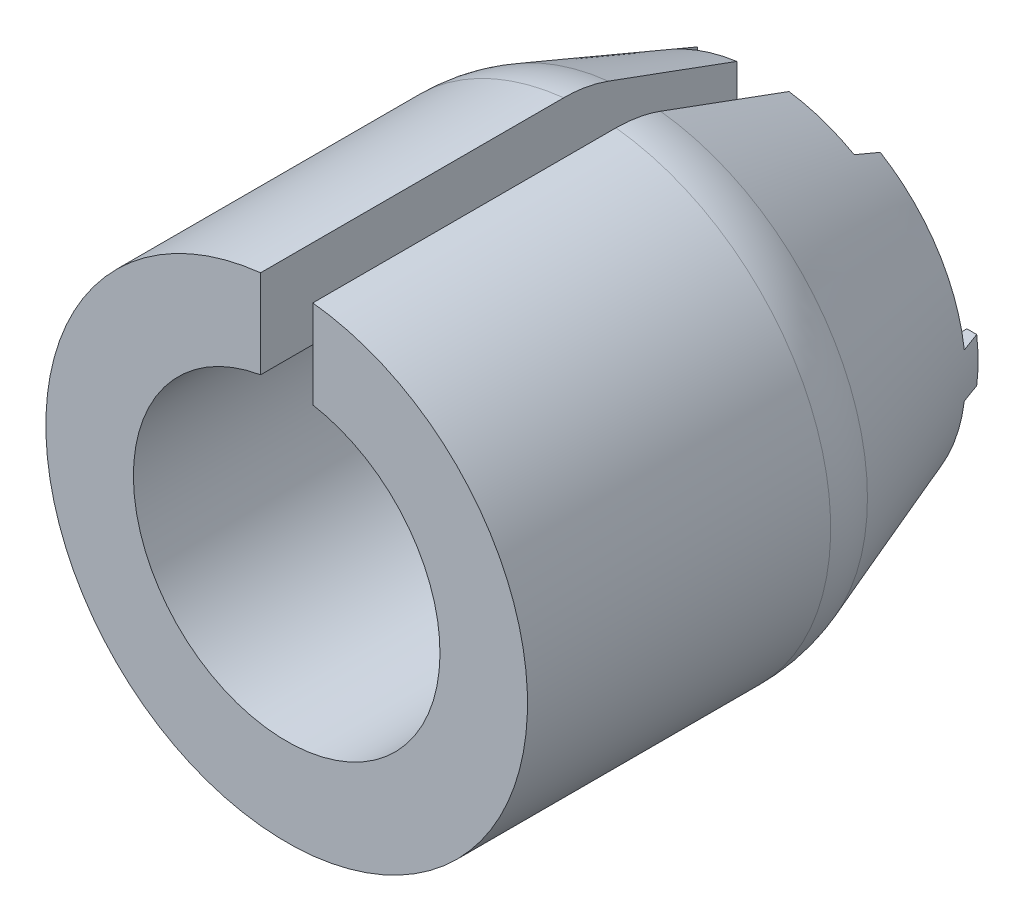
ISO-10303-21;
HEADER;
FILE_DESCRIPTION(('STEP AP214'),'2;1');
FILE_NAME('part.step','',(''),(''),'','','');
FILE_SCHEMA(('AUTOMOTIVE_DESIGN { 1 0 10303 214 1 1 1 1 }'));
ENDSEC;
DATA;
#1=APPLICATION_CONTEXT('core data for automotive mechanical design processes');
#2=APPLICATION_PROTOCOL_DEFINITION('international standard','automotive_design',2000,#1);
#3=PRODUCT_CONTEXT('',#1,'mechanical');
#4=PRODUCT('Part','Part','',(#3));
#5=PRODUCT_RELATED_PRODUCT_CATEGORY('part','',(#4));
#6=PRODUCT_DEFINITION_FORMATION('','',#4);
#7=PRODUCT_DEFINITION_CONTEXT('part definition',#1,'design');
#8=PRODUCT_DEFINITION('design','',#6,#7);
#9=PRODUCT_DEFINITION_SHAPE('','',#8);
#10=(LENGTH_UNIT() NAMED_UNIT(*) SI_UNIT(.MILLI.,.METRE.));
#11=(NAMED_UNIT(*) PLANE_ANGLE_UNIT() SI_UNIT($,.RADIAN.));
#12=(NAMED_UNIT(*) SI_UNIT($,.STERADIAN.) SOLID_ANGLE_UNIT());
#13=UNCERTAINTY_MEASURE_WITH_UNIT(LENGTH_MEASURE(1.E-05),#10,'distance_accuracy_value','');
#14=(GEOMETRIC_REPRESENTATION_CONTEXT(3) GLOBAL_UNCERTAINTY_ASSIGNED_CONTEXT((#13)) GLOBAL_UNIT_ASSIGNED_CONTEXT((#10,
#11,#12)) REPRESENTATION_CONTEXT('',''));
#15=CARTESIAN_POINT('',(0.,0.,0.));
#16=DIRECTION('',(0.,0.,1.));
#17=DIRECTION('',(1.,0.,0.));
#18=AXIS2_PLACEMENT_3D('',#15,#16,#17);
#19=CARTESIAN_POINT('',(2.,25.,15.));
#20=DIRECTION('',(1.,0.,0.));
#21=DIRECTION('',(0.,1.,0.));
#22=AXIS2_PLACEMENT_3D('',#19,#20,#21);
#23=PLANE('',#22);
#24=DIRECTION('',(0.,0.,-1.));
#25=VECTOR('',#24,1.);
#26=CARTESIAN_POINT('',(2.,18.3508886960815,40.));
#27=LINE('',#26,#25);
#28=CARTESIAN_POINT('',(2.,18.3508886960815,40.));
#29=VERTEX_POINT('',#28);
#30=CARTESIAN_POINT('',(2.,18.3508886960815,16.7632698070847));
#31=VERTEX_POINT('',#30);
#32=EDGE_CURVE('E210',#29,#31,#27,.T.);
#33=ORIENTED_EDGE('',*,*,#32,.T.);
#34=CARTESIAN_POINT('',(2.,18.3508886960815,16.7632698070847));
#35=CARTESIAN_POINT('',(2.,18.3509221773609,16.4711897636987));
#36=CARTESIAN_POINT('',(2.,18.3380164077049,16.1791158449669));
#37=CARTESIAN_POINT('',(2.,18.2867759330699,15.5994570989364));
#38=CARTESIAN_POINT('',(2.,18.2486362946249,15.3118550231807));
#39=CARTESIAN_POINT('',(2.,18.1473690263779,14.7410849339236));
#40=CARTESIAN_POINT('',(2.,18.084241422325,14.4579169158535));
#41=CARTESIAN_POINT('',(2.,17.9329556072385,13.8960077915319));
#42=CARTESIAN_POINT('',(2.,17.844608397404,13.6173175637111));
#43=CARTESIAN_POINT('',(2.,17.7441220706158,13.343068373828));
#44=B_SPLINE_CURVE_WITH_KNOTS('',3,(#34,#35,#36,#37,#38,#39,#40,#41,#42,#43),.UNSPECIFIED.,.F.,
.F.,(4,2,2,2,4),(0.,0.875945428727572,1.74519739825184,2.61444847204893,3.49039299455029),.UNSPECIFIED.);
#45=CARTESIAN_POINT('',(2.,17.7441220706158,13.343068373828));
#46=VERTEX_POINT('',#45);
#47=EDGE_CURVE('E54',#31,#46,#44,.T.);
#48=ORIENTED_EDGE('',*,*,#47,.T.);
#49=CARTESIAN_POINT('',(2.,6.41526344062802,-17.2547295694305));
#50=CARTESIAN_POINT('',(2.,6.56390800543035,-16.8648244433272));
#51=CARTESIAN_POINT('',(2.,6.7121636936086,-16.4747713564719));
#52=CARTESIAN_POINT('',(2.,7.0080167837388,-15.6944159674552));
#53=CARTESIAN_POINT('',(2.,7.15561418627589,-15.3041136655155));
#54=CARTESIAN_POINT('',(2.,7.59759766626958,-14.1329043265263));
#55=CARTESIAN_POINT('',(2.,7.89117591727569,-13.3516924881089));
#56=CARTESIAN_POINT('',(2.,8.476797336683,-11.7887002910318));
#57=CARTESIAN_POINT('',(2.,8.76884051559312,-11.006919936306));
#58=CARTESIAN_POINT('',(2.,9.35178663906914,-9.44293356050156));
#59=CARTESIAN_POINT('',(2.,9.64268958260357,-8.6607275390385));
#60=CARTESIAN_POINT('',(2.,10.533850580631,-6.26048030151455));
#61=CARTESIAN_POINT('',(2.,11.1327080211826,-4.64191919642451));
#62=CARTESIAN_POINT('',(2.,12.3282153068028,-1.40397856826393));
#63=CARTESIAN_POINT('',(2.,12.9248651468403,0.215400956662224));
#64=CARTESIAN_POINT('',(2.,14.10690648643,3.42807582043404));
#65=CARTESIAN_POINT('',(2.,14.6923218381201,5.02136238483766));
#66=CARTESIAN_POINT('',(2.,15.8621656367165,8.20829774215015));
#67=CARTESIAN_POINT('',(2.,16.4465940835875,9.801946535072));
#68=CARTESIAN_POINT('',(2.,18.1988245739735,14.5832760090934));
#69=CARTESIAN_POINT('',(2.,19.3655728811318,17.7713428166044));
#70=CARTESIAN_POINT('',(2.,21.593649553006,23.8641314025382));
#71=CARTESIAN_POINT('',(2.,22.6551132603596,26.7688037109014));
#72=CARTESIAN_POINT('',(2.,24.7771645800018,32.5784684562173));
#73=CARTESIAN_POINT('',(2.,25.8377521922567,35.4834608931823));
#74=CARTESIAN_POINT('',(2.,27.9583314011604,41.2936645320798));
#75=CARTESIAN_POINT('',(2.,29.0183229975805,44.1988757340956));
#76=CARTESIAN_POINT('',(2.,31.1378659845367,50.0094584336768));
#77=CARTESIAN_POINT('',(2.,32.1974173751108,52.9148299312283));
#78=CARTESIAN_POINT('',(2.,33.2568268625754,55.8202531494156));
#79=B_SPLINE_CURVE_WITH_KNOTS('',3,(#49,#50,#51,#52,#53,#54,#55,#56,#57,#58,#59,#60,#61,#62,#63,
#64,#65,#66,#67,#68,#69,#70,#71,#72,#73,#74,#75,#76,#77,#78),.UNSPECIFIED.,.F.,.F.,(4,2,2,2,2,2,
2,2,2,2,2,2,2,2,4),(0.,1.25183440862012,2.50366770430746,5.00732669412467,7.51096852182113,
10.0146126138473,15.1919960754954,20.3693913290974,25.4616848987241,30.5539786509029,
40.7385564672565,50.0161873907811,59.2938186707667,68.5714535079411,77.8490875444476),.UNSPECIFIED.);
#80=CARTESIAN_POINT('',(2.,14.1330853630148,3.5));
#81=VERTEX_POINT('',#80);
#82=EDGE_CURVE('E340',#81,#46,#79,.T.);
#83=ORIENTED_EDGE('',*,*,#82,.F.);
#84=DIRECTION('',(0.,-1.,0.));
#85=VECTOR('',#84,1.);
#86=CARTESIAN_POINT('',(2.,0.,3.5));
#87=LINE('',#86,#85);
#88=CARTESIAN_POINT('',(2.,11.5785361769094,3.5));
#89=VERTEX_POINT('',#88);
#90=EDGE_CURVE('E191',#81,#89,#87,.T.);
#91=ORIENTED_EDGE('',*,*,#90,.T.);
#92=DIRECTION('',(0.,0.,-1.));
#93=VECTOR('',#92,1.);
#94=CARTESIAN_POINT('',(2.,11.5785361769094,15.));
#95=LINE('',#94,#93);
#96=CARTESIAN_POINT('',(2.00000000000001,11.5785361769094,40.));
#97=VERTEX_POINT('',#96);
#98=EDGE_CURVE('E341',#89,#97,#95,.F.);
#99=ORIENTED_EDGE('',*,*,#98,.T.);
#100=DIRECTION('',(0.,-1.,0.));
#101=VECTOR('',#100,1.);
#102=CARTESIAN_POINT('',(2.,18.3508886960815,40.));
#103=LINE('',#102,#101);
#104=EDGE_CURVE('E205',#29,#97,#103,.T.);
#105=ORIENTED_EDGE('',*,*,#104,.F.);
#106=EDGE_LOOP('',(#33,#48,#83,#91,#99,#105));
#107=FACE_BOUND('',#106,.T.);
#108=ADVANCED_FACE('F26',(#107),#23,.F.);
#109=CARTESIAN_POINT('',(-2.,25.,15.));
#110=DIRECTION('',(-1.,0.,0.));
#111=DIRECTION('',(0.,-1.,0.));
#112=AXIS2_PLACEMENT_3D('',#109,#110,#111);
#113=PLANE('',#112);
#114=CARTESIAN_POINT('',(-2.,6.41526344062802,-17.2547295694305));
#115=CARTESIAN_POINT('',(-2.,6.56390800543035,-16.8648244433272));
#116=CARTESIAN_POINT('',(-2.,6.7121636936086,-16.4747713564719));
#117=CARTESIAN_POINT('',(-2.,7.0080167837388,-15.6944159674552));
#118=CARTESIAN_POINT('',(-2.,7.15561418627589,-15.3041136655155));
#119=CARTESIAN_POINT('',(-2.,7.59759766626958,-14.1329043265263));
#120=CARTESIAN_POINT('',(-2.,7.89117591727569,-13.3516924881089));
#121=CARTESIAN_POINT('',(-2.,8.476797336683,-11.7887002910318));
#122=CARTESIAN_POINT('',(-2.,8.76884051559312,-11.006919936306));
#123=CARTESIAN_POINT('',(-2.,9.35178663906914,-9.44293356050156));
#124=CARTESIAN_POINT('',(-2.,9.64268958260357,-8.6607275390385));
#125=CARTESIAN_POINT('',(-2.,10.533850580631,-6.26048030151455));
#126=CARTESIAN_POINT('',(-2.,11.1327080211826,-4.64191919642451));
#127=CARTESIAN_POINT('',(-2.,12.3282153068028,-1.40397856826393));
#128=CARTESIAN_POINT('',(-2.,12.9248651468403,0.215400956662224));
#129=CARTESIAN_POINT('',(-2.,14.10690648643,3.42807582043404));
#130=CARTESIAN_POINT('',(-2.,14.6923218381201,5.02136238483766));
#131=CARTESIAN_POINT('',(-2.,15.8621656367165,8.20829774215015));
#132=CARTESIAN_POINT('',(-2.,16.4465940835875,9.801946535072));
#133=CARTESIAN_POINT('',(-2.,18.1988245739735,14.5832760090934));
#134=CARTESIAN_POINT('',(-2.,19.3655728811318,17.7713428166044));
#135=CARTESIAN_POINT('',(-2.,21.593649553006,23.8641314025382));
#136=CARTESIAN_POINT('',(-2.,22.6551132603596,26.7688037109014));
#137=CARTESIAN_POINT('',(-2.,24.7771645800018,32.5784684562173));
#138=CARTESIAN_POINT('',(-2.,25.8377521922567,35.4834608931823));
#139=CARTESIAN_POINT('',(-2.,27.9583314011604,41.2936645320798));
#140=CARTESIAN_POINT('',(-2.,29.0183229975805,44.1988757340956));
#141=CARTESIAN_POINT('',(-2.,31.1378659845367,50.0094584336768));
#142=CARTESIAN_POINT('',(-2.,32.1974173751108,52.9148299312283));
#143=CARTESIAN_POINT('',(-2.,33.2568268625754,55.8202531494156));
#144=B_SPLINE_CURVE_WITH_KNOTS('',3,(#114,#115,#116,#117,#118,#119,#120,#121,#122,#123,#124,
#125,#126,#127,#128,#129,#130,#131,#132,#133,#134,#135,#136,#137,#138,#139,#140,#141,#142,#143),
.UNSPECIFIED.,.F.,.F.,(4,2,2,2,2,2,2,2,2,2,2,2,2,2,4),(0.,1.25183440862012,2.50366770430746,
5.00732669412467,7.51096852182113,10.0146126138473,15.1919960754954,20.3693913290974,
25.4616848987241,30.5539786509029,40.7385564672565,50.0161873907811,59.2938186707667,
68.5714535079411,77.8490875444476),.UNSPECIFIED.);
#145=CARTESIAN_POINT('',(-2.,17.7441220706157,13.3430683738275));
#146=VERTEX_POINT('',#145);
#147=CARTESIAN_POINT('',(-2.,14.1330853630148,3.5));
#148=VERTEX_POINT('',#147);
#149=EDGE_CURVE('E334',#146,#148,#144,.F.);
#150=ORIENTED_EDGE('',*,*,#149,.F.);
#151=CARTESIAN_POINT('',(-1.99999999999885,17.744122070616,13.343068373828));
#152=CARTESIAN_POINT('',(-1.99999999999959,17.8446083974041,13.6173175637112));
#153=CARTESIAN_POINT('',(-1.99999999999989,17.9329556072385,13.8960077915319));
#154=CARTESIAN_POINT('',(-2.00000000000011,18.084241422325,14.4579169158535));
#155=CARTESIAN_POINT('',(-2.00000000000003,18.1473690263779,14.7410849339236));
#156=CARTESIAN_POINT('',(-1.99999999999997,18.2486362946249,15.3118550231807));
#157=CARTESIAN_POINT('',(-1.99999999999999,18.2867759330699,15.5994570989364));
#158=CARTESIAN_POINT('',(-2.00000000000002,18.3380164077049,16.1791158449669));
#159=CARTESIAN_POINT('',(-2.00000000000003,18.3509221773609,16.4711897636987));
#160=CARTESIAN_POINT('',(-2.,18.3508886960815,16.7632698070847));
#161=B_SPLINE_CURVE_WITH_KNOTS('',3,(#151,#152,#153,#154,#155,#156,#157,#158,#159,#160),
.UNSPECIFIED.,.F.,.F.,(4,2,2,2,4),(0.,0.875944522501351,1.74519559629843,2.61444756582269,
3.49039299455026),.UNSPECIFIED.);
#162=CARTESIAN_POINT('',(-2.,18.3508886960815,16.7632698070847));
#163=VERTEX_POINT('',#162);
#164=EDGE_CURVE('E11',#146,#163,#161,.T.);
#165=ORIENTED_EDGE('',*,*,#164,.T.);
#166=DIRECTION('',(0.,0.,-1.));
#167=VECTOR('',#166,1.);
#168=CARTESIAN_POINT('',(-2.,18.3508886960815,40.));
#169=LINE('',#168,#167);
#170=CARTESIAN_POINT('',(-2.,18.3508886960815,40.));
#171=VERTEX_POINT('',#170);
#172=EDGE_CURVE('E197',#171,#163,#169,.T.);
#173=ORIENTED_EDGE('',*,*,#172,.F.);
#174=DIRECTION('',(0.,1.,0.));
#175=VECTOR('',#174,1.);
#176=CARTESIAN_POINT('',(-2.,11.5785361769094,40.));
#177=LINE('',#176,#175);
#178=CARTESIAN_POINT('',(-2.,11.5785361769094,40.));
#179=VERTEX_POINT('',#178);
#180=EDGE_CURVE('E194',#179,#171,#177,.T.);
#181=ORIENTED_EDGE('',*,*,#180,.F.);
#182=DIRECTION('',(0.,0.,-1.));
#183=VECTOR('',#182,1.);
#184=CARTESIAN_POINT('',(-2.,11.5785361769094,15.));
#185=LINE('',#184,#183);
#186=CARTESIAN_POINT('',(-2.,11.5785361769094,3.5));
#187=VERTEX_POINT('',#186);
#188=EDGE_CURVE('E180',#179,#187,#185,.T.);
#189=ORIENTED_EDGE('',*,*,#188,.T.);
#190=DIRECTION('',(0.,1.,0.));
#191=VECTOR('',#190,1.);
#192=CARTESIAN_POINT('',(-2.,0.,3.5));
#193=LINE('',#192,#191);
#194=EDGE_CURVE('E355',#187,#148,#193,.T.);
#195=ORIENTED_EDGE('',*,*,#194,.T.);
#196=EDGE_LOOP('',(#150,#165,#173,#181,#189,#195));
#197=FACE_BOUND('',#196,.T.);
#198=ADVANCED_FACE('F195',(#197),#113,.F.);
#199=CARTESIAN_POINT('',(0.,0.,3.5));
#200=DIRECTION('',(0.,0.,-1.));
#201=DIRECTION('',(-1.,0.,0.));
#202=AXIS2_PLACEMENT_3D('',#199,#200,#201);
#203=CYLINDRICAL_SURFACE('',#202,12.25);
#204=CARTESIAN_POINT('',(0.,0.,1.5));
#205=DIRECTION('',(0.,0.,1.));
#206=DIRECTION('',(-1.,0.,0.));
#207=AXIS2_PLACEMENT_3D('',#204,#205,#206);
#208=CIRCLE('',#207,12.25);
#209=CARTESIAN_POINT('',(7.,-10.0529846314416,1.5));
#210=VERTEX_POINT('',#209);
#211=CARTESIAN_POINT('',(12.1314673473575,-1.7,1.5));
#212=VERTEX_POINT('',#211);
#213=EDGE_CURVE('E283',#210,#212,#208,.T.);
#214=ORIENTED_EDGE('',*,*,#213,.F.);
#215=DIRECTION('',(0.,0.,-1.));
#216=VECTOR('',#215,1.);
#217=CARTESIAN_POINT('',(7.,-10.0529846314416,3.5));
#218=LINE('',#217,#216);
#219=CARTESIAN_POINT('',(7.,-10.0529846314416,3.5));
#220=VERTEX_POINT('',#219);
#221=EDGE_CURVE('E228',#210,#220,#218,.F.);
#222=ORIENTED_EDGE('',*,*,#221,.T.);
#223=CARTESIAN_POINT('',(0.,0.,3.5));
#224=DIRECTION('',(0.,0.,-1.));
#225=DIRECTION('',(-1.,0.,0.));
#226=AXIS2_PLACEMENT_3D('',#223,#224,#225);
#227=CIRCLE('',#226,12.25);
#228=CARTESIAN_POINT('',(7.,10.0529846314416,3.5));
#229=VERTEX_POINT('',#228);
#230=EDGE_CURVE('E352',#229,#220,#227,.T.);
#231=ORIENTED_EDGE('',*,*,#230,.F.);
#232=DIRECTION('',(0.,0.,-1.));
#233=VECTOR('',#232,1.);
#234=CARTESIAN_POINT('',(7.,10.0529846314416,3.5));
#235=LINE('',#234,#233);
#236=CARTESIAN_POINT('',(7.,10.0529846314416,1.5));
#237=VERTEX_POINT('',#236);
#238=EDGE_CURVE('E225',#229,#237,#235,.T.);
#239=ORIENTED_EDGE('',*,*,#238,.T.);
#240=CARTESIAN_POINT('',(0.,0.,1.5));
#241=DIRECTION('',(0.,0.,1.));
#242=DIRECTION('',(-1.,0.,0.));
#243=AXIS2_PLACEMENT_3D('',#240,#241,#242);
#244=CIRCLE('',#243,12.25);
#245=CARTESIAN_POINT('',(12.1314673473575,1.7,1.5));
#246=VERTEX_POINT('',#245);
#247=EDGE_CURVE('E412',#246,#237,#244,.T.);
#248=ORIENTED_EDGE('',*,*,#247,.F.);
#249=DIRECTION('',(0.,0.,-1.));
#250=VECTOR('',#249,1.);
#251=CARTESIAN_POINT('',(12.1314673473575,1.7,1.5));
#252=LINE('',#251,#250);
#253=CARTESIAN_POINT('',(12.1314673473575,1.7,0.));
#254=VERTEX_POINT('',#253);
#255=EDGE_CURVE('E421',#246,#254,#252,.T.);
#256=ORIENTED_EDGE('',*,*,#255,.T.);
#257=CARTESIAN_POINT('',(0.,0.,0.));
#258=DIRECTION('',(0.,0.,-1.));
#259=DIRECTION('',(-1.,0.,0.));
#260=AXIS2_PLACEMENT_3D('',#257,#258,#259);
#261=CIRCLE('',#260,12.25);
#262=CARTESIAN_POINT('',(12.1314673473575,-1.7,0.));
#263=VERTEX_POINT('',#262);
#264=EDGE_CURVE('E347',#254,#263,#261,.T.);
#265=ORIENTED_EDGE('',*,*,#264,.T.);
#266=DIRECTION('',(0.,0.,-1.));
#267=VECTOR('',#266,1.);
#268=CARTESIAN_POINT('',(12.1314673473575,-1.7,1.5));
#269=LINE('',#268,#267);
#270=EDGE_CURVE('E293',#212,#263,#269,.T.);
#271=ORIENTED_EDGE('',*,*,#270,.F.);
#272=EDGE_LOOP('',(#214,#222,#231,#239,#248,#256,#265,#271));
#273=FACE_BOUND('',#272,.T.);
#274=ADVANCED_FACE('F329',(#273),#203,.F.);
#275=CARTESIAN_POINT('',(0.,0.,1.5));
#276=DIRECTION('',(0.,0.,-1.));
#277=DIRECTION('',(-1.,0.,0.));
#278=AXIS2_PLACEMENT_3D('',#275,#276,#277);
#279=PLANE('',#278);
#280=DIRECTION('',(0.,-1.,0.));
#281=VECTOR('',#280,1.);
#282=CARTESIAN_POINT('',(7.,15.,1.5));
#283=LINE('',#282,#281);
#284=CARTESIAN_POINT('',(7.,-11.5971076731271,1.5));
#285=VERTEX_POINT('',#284);
#286=EDGE_CURVE('E213',#210,#285,#283,.T.);
#287=ORIENTED_EDGE('',*,*,#286,.F.);
#288=ORIENTED_EDGE('',*,*,#213,.T.);
#289=DIRECTION('',(1.,0.,0.));
#290=VECTOR('',#289,1.);
#291=CARTESIAN_POINT('',(12.1314673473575,-1.7,1.5));
#292=LINE('',#291,#290);
#293=CARTESIAN_POINT('',(13.4388580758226,-1.7,1.5));
#294=VERTEX_POINT('',#293);
#295=EDGE_CURVE('E287',#212,#294,#292,.T.);
#296=ORIENTED_EDGE('',*,*,#295,.T.);
#297=CARTESIAN_POINT('',(0.,0.,1.5));
#298=DIRECTION('',(0.,0.,-1.));
#299=DIRECTION('',(-1.,0.,0.));
#300=AXIS2_PLACEMENT_3D('',#297,#298,#299);
#301=CIRCLE('',#300,13.5459553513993);
#302=EDGE_CURVE('E300',#294,#285,#301,.T.);
#303=ORIENTED_EDGE('',*,*,#302,.T.);
#304=EDGE_LOOP('',(#287,#288,#296,#303));
#305=FACE_BOUND('',#304,.T.);
#306=ADVANCED_FACE('F473',(#305),#279,.T.);
#307=CARTESIAN_POINT('',(0.,0.,0.));
#308=DIRECTION('',(0.,0.,1.));
#309=DIRECTION('',(1.,0.,0.));
#310=AXIS2_PLACEMENT_3D('',#307,#308,#309);
#311=PLANE('',#310);
#312=CARTESIAN_POINT('',(0.,0.,0.));
#313=DIRECTION('',(0.,0.,1.));
#314=DIRECTION('',(1.,0.,0.));
#315=AXIS2_PLACEMENT_3D('',#312,#313,#314);
#316=CIRCLE('',#315,13.);
#317=CARTESIAN_POINT('',(-12.8883668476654,1.7,0.));
#318=VERTEX_POINT('',#317);
#319=CARTESIAN_POINT('',(-12.8883668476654,-1.7,0.));
#320=VERTEX_POINT('',#319);
#321=EDGE_CURVE('E353',#318,#320,#316,.T.);
#322=ORIENTED_EDGE('',*,*,#321,.F.);
#323=DIRECTION('',(-1.,0.,0.));
#324=VECTOR('',#323,1.);
#325=CARTESIAN_POINT('',(-12.1314673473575,1.7,0.));
#326=LINE('',#325,#324);
#327=CARTESIAN_POINT('',(-12.1314673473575,1.7,0.));
#328=VERTEX_POINT('',#327);
#329=EDGE_CURVE('E401',#328,#318,#326,.T.);
#330=ORIENTED_EDGE('',*,*,#329,.F.);
#331=CARTESIAN_POINT('',(-12.1314673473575,-1.7,0.));
#332=VERTEX_POINT('',#331);
#333=EDGE_CURVE('E346',#332,#328,#261,.T.);
#334=ORIENTED_EDGE('',*,*,#333,.F.);
#335=DIRECTION('',(1.,0.,0.));
#336=VECTOR('',#335,1.);
#337=CARTESIAN_POINT('',(-12.1314673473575,-1.7,0.));
#338=LINE('',#337,#336);
#339=EDGE_CURVE('E281',#320,#332,#338,.T.);
#340=ORIENTED_EDGE('',*,*,#339,.F.);
#341=EDGE_LOOP('',(#322,#330,#334,#340));
#342=FACE_BOUND('',#341,.T.);
#343=ADVANCED_FACE('F437',(#342),#311,.F.);
#344=CARTESIAN_POINT('',(0.,0.,0.));
#345=DIRECTION('',(0.,0.,1.));
#346=DIRECTION('',(1.,0.,0.));
#347=AXIS2_PLACEMENT_3D('',#344,#345,#346);
#348=CONICAL_SURFACE('',#347,13.,0.349065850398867);
#349=ORIENTED_EDGE('',*,*,#82,.T.);
#350=CARTESIAN_POINT('',(0.,0.,13.343068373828));
#351=DIRECTION('',(0.,0.,-1.));
#352=DIRECTION('',(-1.,0.,0.));
#353=AXIS2_PLACEMENT_3D('',#350,#351,#352);
#354=CIRCLE('',#353,17.8564797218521);
#355=EDGE_CURVE('E40',#46,#146,#354,.T.);
#356=ORIENTED_EDGE('',*,*,#355,.T.);
#357=ORIENTED_EDGE('',*,*,#149,.T.);
#358=CARTESIAN_POINT('',(0.,0.,3.5));
#359=DIRECTION('',(0.,0.,-1.));
#360=DIRECTION('',(-1.,0.,0.));
#361=AXIS2_PLACEMENT_3D('',#358,#359,#360);
#362=CIRCLE('',#361,14.2738958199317);
#363=CARTESIAN_POINT('',(-7.,12.4396182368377,3.5));
#364=VERTEX_POINT('',#363);
#365=EDGE_CURVE('E390',#364,#148,#362,.T.);
#366=ORIENTED_EDGE('',*,*,#365,.F.);
#367=CARTESIAN_POINT('',(-7.,19.6291767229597,21.5401556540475));
#368=CARTESIAN_POINT('',(-7.,19.3988615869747,20.9441395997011));
#369=CARTESIAN_POINT('',(-7.,19.1681520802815,20.3482759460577));
#370=CARTESIAN_POINT('',(-7.,18.7058473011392,19.1568917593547));
#371=CARTESIAN_POINT('',(-7.,18.4742520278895,18.5613712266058));
#372=CARTESIAN_POINT('',(-7.,17.7779749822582,16.7753380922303));
#373=CARTESIAN_POINT('',(-7.,17.3118194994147,15.5853993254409));
#374=CARTESIAN_POINT('',(-7.,16.3737448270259,13.205409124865));
#375=CARTESIAN_POINT('',(-7.,15.9018170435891,12.0153610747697));
#376=CARTESIAN_POINT('',(-7.,14.9515589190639,9.63785907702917));
#377=CARTESIAN_POINT('',(-7.,14.4732287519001,8.45040505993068));
#378=CARTESIAN_POINT('',(-7.,13.4964177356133,6.05024495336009));
#379=CARTESIAN_POINT('',(-7.,12.9977293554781,4.83762303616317));
#380=CARTESIAN_POINT('',(-7.,12.2404200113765,3.02249782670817));
#381=CARTESIAN_POINT('',(-7.,11.986426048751,2.41806417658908));
#382=CARTESIAN_POINT('',(-7.,11.4747223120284,1.21077230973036));
#383=CARTESIAN_POINT('',(-7.,11.2170125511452,0.607914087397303));
#384=CARTESIAN_POINT('',(-7.,10.6973239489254,-0.595332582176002));
#385=CARTESIAN_POINT('',(-7.,10.4353490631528,-1.19572273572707));
#386=CARTESIAN_POINT('',(-7.,9.90587230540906,-2.39405987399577));
#387=CARTESIAN_POINT('',(-7.,9.63837048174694,-2.99200688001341));
#388=CARTESIAN_POINT('',(-7.,9.09646374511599,-4.18467024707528));
#389=CARTESIAN_POINT('',(-7.,8.82205979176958,-4.77938704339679));
#390=CARTESIAN_POINT('',(-7.,8.26436456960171,-5.96463042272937));
#391=CARTESIAN_POINT('',(-7.,7.98107369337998,-6.55515718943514));
#392=CARTESIAN_POINT('',(-7.,7.55800689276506,-7.41479923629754));
#393=CARTESIAN_POINT('',(-7.,7.4228684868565,-7.68619807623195));
#394=CARTESIAN_POINT('',(-7.,7.14965449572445,-8.22752002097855));
#395=CARTESIAN_POINT('',(-7.,7.01157887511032,-8.49744310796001));
#396=CARTESIAN_POINT('',(-7.,6.73194430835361,-9.03566196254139));
#397=CARTESIAN_POINT('',(-7.,6.59038356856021,-9.30395679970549));
#398=CARTESIAN_POINT('',(-7.,6.30324991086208,-9.83838996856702));
#399=CARTESIAN_POINT('',(-7.,6.15767705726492,-10.1045283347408));
#400=CARTESIAN_POINT('',(-7.,5.86163018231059,-10.6343661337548));
#401=CARTESIAN_POINT('',(-7.,5.71115213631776,-10.8980633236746));
#402=CARTESIAN_POINT('',(-7.,5.40442805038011,-11.4220784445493));
#403=CARTESIAN_POINT('',(-7.,5.2481822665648,-11.6823965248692));
#404=CARTESIAN_POINT('',(-7.,4.92873183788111,-12.1984615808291));
#405=CARTESIAN_POINT('',(-7.,4.76553276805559,-12.4542119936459));
#406=CARTESIAN_POINT('',(-7.,4.43032534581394,-12.959846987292));
#407=CARTESIAN_POINT('',(-7.,4.25831878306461,-13.2097327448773));
#408=CARTESIAN_POINT('',(-7.,3.9374060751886,-13.653769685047));
#409=CARTESIAN_POINT('',(-7.,3.79047674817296,-13.8493431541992));
#410=CARTESIAN_POINT('',(-7.,3.48738085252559,-14.2334619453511));
#411=CARTESIAN_POINT('',(-7.,3.3312086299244,-14.4220028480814));
#412=CARTESIAN_POINT('',(-7.,3.0082569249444,-14.7879793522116));
#413=CARTESIAN_POINT('',(-7.,2.84154237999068,-14.9654716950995));
#414=CARTESIAN_POINT('',(-7.,2.49382772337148,-15.3056980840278));
#415=CARTESIAN_POINT('',(-7.,2.31284853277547,-15.4684530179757));
#416=CARTESIAN_POINT('',(-7.,1.97896799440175,-15.7346270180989));
#417=CARTESIAN_POINT('',(-7.,1.82994980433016,-15.8428477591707));
#418=CARTESIAN_POINT('',(-7.,1.5198624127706,-16.0411298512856));
#419=CARTESIAN_POINT('',(-7.,1.35878244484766,-16.1311747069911));
#420=CARTESIAN_POINT('',(-7.,1.02153987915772,-16.2865498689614));
#421=CARTESIAN_POINT('',(-7.,0.845185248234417,-16.3514837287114));
#422=CARTESIAN_POINT('',(-7.,0.573972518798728,-16.421911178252));
#423=CARTESIAN_POINT('',(-7.,0.482545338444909,-16.4408861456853));
#424=CARTESIAN_POINT('',(-7.,0.298178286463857,-16.4690797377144));
#425=CARTESIAN_POINT('',(-7.,0.205238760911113,-16.4783005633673));
#426=CARTESIAN_POINT('',(-7.,0.03050664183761,-16.4859885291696));
#427=CARTESIAN_POINT('',(-7.,-0.0512350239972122,-16.4856502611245));
#428=CARTESIAN_POINT('',(-7.,-0.21432306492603,-16.4771595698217));
#429=CARTESIAN_POINT('',(-7.,-0.29566930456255,-16.4690046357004));
#430=CARTESIAN_POINT('',(-7.,-0.538162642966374,-16.4331884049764));
#431=CARTESIAN_POINT('',(-7.,-0.697705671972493,-16.3941734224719));
#432=CARTESIAN_POINT('',(-7.,-1.04905238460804,-16.2774876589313));
#433=CARTESIAN_POINT('',(-7.,-1.23829984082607,-16.1923471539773));
#434=CARTESIAN_POINT('',(-7.,-1.51038253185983,-16.04378973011));
#435=CARTESIAN_POINT('',(-7.,-1.59922460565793,-15.9907098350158));
#436=CARTESIAN_POINT('',(-7.,-1.77320282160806,-15.8787626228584));
#437=CARTESIAN_POINT('',(-7.,-1.85833924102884,-15.8198957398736));
#438=CARTESIAN_POINT('',(-7.,-2.04365365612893,-15.6838082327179));
#439=CARTESIAN_POINT('',(-7.,-2.14296581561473,-15.6054174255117));
#440=CARTESIAN_POINT('',(-7.,-2.33690698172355,-15.4430156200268));
#441=CARTESIAN_POINT('',(-7.,-2.43153415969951,-15.3590024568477));
#442=CARTESIAN_POINT('',(-7.,-2.70942699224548,-15.1000541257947));
#443=CARTESIAN_POINT('',(-7.,-2.88643913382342,-14.9184131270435));
#444=CARTESIAN_POINT('',(-7.,-3.22853677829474,-14.5422296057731));
#445=CARTESIAN_POINT('',(-7.,-3.39353394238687,-14.3476084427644));
#446=CARTESIAN_POINT('',(-7.,-3.63316911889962,-14.0495729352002));
#447=CARTESIAN_POINT('',(-7.,-3.71170456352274,-13.9492559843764));
#448=CARTESIAN_POINT('',(-7.,-3.8664587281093,-13.7468559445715));
#449=CARTESIAN_POINT('',(-7.,-3.94267752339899,-13.6447729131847));
#450=CARTESIAN_POINT('',(-7.,-4.18073809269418,-13.3191871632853));
#451=CARTESIAN_POINT('',(-7.,-4.33878473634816,-13.0929065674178));
#452=CARTESIAN_POINT('',(-7.,-4.6472128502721,-12.6351609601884));
#453=CARTESIAN_POINT('',(-7.,-4.7975927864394,-12.4036949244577));
#454=CARTESIAN_POINT('',(-7.,-5.09219649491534,-11.936684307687));
#455=CARTESIAN_POINT('',(-7.,-5.23641629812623,-11.701137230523));
#456=CARTESIAN_POINT('',(-7.,-5.51969784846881,-11.2269534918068));
#457=CARTESIAN_POINT('',(-7.,-5.65875928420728,-10.9883166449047));
#458=CARTESIAN_POINT('',(-7.,-5.93290787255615,-10.5079639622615));
#459=CARTESIAN_POINT('',(-7.,-6.06798390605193,-10.2662417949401));
#460=CARTESIAN_POINT('',(-7.,-6.33444822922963,-9.78077048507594));
#461=CARTESIAN_POINT('',(-7.,-6.46583642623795,-9.53702129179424));
#462=CARTESIAN_POINT('',(-7.,-6.8551816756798,-8.80346796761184));
#463=CARTESIAN_POINT('',(-7.,-7.10842917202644,-8.31116349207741));
#464=CARTESIAN_POINT('',(-7.,-7.60602568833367,-7.32069234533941));
#465=CARTESIAN_POINT('',(-7.,-7.85035291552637,-6.82251480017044));
#466=CARTESIAN_POINT('',(-7.,-8.33161339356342,-5.82255566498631));
#467=CARTESIAN_POINT('',(-7.,-8.56854600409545,-5.32077376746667));
#468=CARTESIAN_POINT('',(-7.,-9.03613508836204,-4.31525572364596));
#469=CARTESIAN_POINT('',(-7.,-9.26680079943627,-3.81152386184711));
#470=CARTESIAN_POINT('',(-7.,-9.7233344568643,-2.80191117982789));
#471=CARTESIAN_POINT('',(-7.,-9.94920253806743,-2.29603042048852));
#472=CARTESIAN_POINT('',(-7.,-10.3869894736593,-1.30513617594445));
#473=CARTESIAN_POINT('',(-7.,-10.599081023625,-0.820198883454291));
#474=CARTESIAN_POINT('',(-7.,-11.0202107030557,0.151000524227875));
#475=CARTESIAN_POINT('',(-7.,-11.2292488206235,0.637262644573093));
#476=CARTESIAN_POINT('',(-7.,-11.8524869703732,2.09772692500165));
#477=CARTESIAN_POINT('',(-7.,-12.2628020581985,3.0735871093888));
#478=CARTESIAN_POINT('',(-7.,-13.0759911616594,5.02919079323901));
#479=CARTESIAN_POINT('',(-7.,-13.4788597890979,6.00893652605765));
#480=CARTESIAN_POINT('',(-7.,-14.2786278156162,7.97086375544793));
#481=CARTESIAN_POINT('',(-7.,-14.6755271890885,8.95304526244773));
#482=CARTESIAN_POINT('',(-7.,-15.4572005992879,10.9008135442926));
#483=CARTESIAN_POINT('',(-7.,-15.8420623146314,11.8663651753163));
#484=CARTESIAN_POINT('',(-7.,-16.6081245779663,13.7989233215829));
#485=CARTESIAN_POINT('',(-7.,-16.9893251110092,14.7659298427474));
#486=CARTESIAN_POINT('',(-7.,-17.7483908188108,16.7002577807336));
#487=CARTESIAN_POINT('',(-7.,-18.1262586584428,17.6675781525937));
#488=CARTESIAN_POINT('',(-7.,-18.8794811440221,19.6031874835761));
#489=CARTESIAN_POINT('',(-7.,-19.2548358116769,20.5714764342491));
#490=CARTESIAN_POINT('',(-7.,-19.6291767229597,21.5401556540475));
#491=B_SPLINE_CURVE_WITH_KNOTS('',3,(#367,#368,#369,#370,#371,#372,#373,#374,#375,#376,#377,
#378,#379,#380,#381,#382,#383,#384,#385,#386,#387,#388,#389,#390,#391,#392,#393,#394,#395,#396,
#397,#398,#399,#400,#401,#402,#403,#404,#405,#406,#407,#408,#409,#410,#411,#412,#413,#414,#415,
#416,#417,#418,#419,#420,#421,#422,#423,#424,#425,#426,#427,#428,#429,#430,#431,#432,#433,#434,
#435,#436,#437,#438,#439,#440,#441,#442,#443,#444,#445,#446,#447,#448,#449,#450,#451,#452,#453,
#454,#455,#456,#457,#458,#459,#460,#461,#462,#463,#464,#465,#466,#467,#468,#469,#470,#471,#472,
#473,#474,#475,#476,#477,#478,#479,#480,#481,#482,#483,#484,#485,#486,#487,#488,#489,#490),
.UNSPECIFIED.,.F.,.F.,(4,2,2,2,2,2,2,2,2,2,2,2,2,2,2,2,2,2,2,2,2,2,2,2,2,2,2,2,2,2,2,2,2,2,2,2,
2,2,2,2,2,2,2,2,2,2,2,2,2,2,2,2,2,2,2,2,2,2,2,2,2,4),(0.,1.91690398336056,3.83380969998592,
7.66776703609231,11.5083736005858,15.3488760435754,19.2823009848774,21.2491866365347,
23.2160652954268,25.1812134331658,27.1463444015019,29.1112036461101,31.0759762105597,
31.9855101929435,32.8950551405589,33.8050784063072,34.7150870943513,35.6258622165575,
36.5365969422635,37.4466147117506,38.3564482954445,39.0900944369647,39.8241940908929,
40.5541448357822,41.2830442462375,41.8345847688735,42.3866236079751,42.9470530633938,
43.2267338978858,43.5063516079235,43.7512004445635,43.9961279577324,44.4861562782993,
45.1051127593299,45.4154349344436,45.7257338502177,46.1050444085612,46.4845018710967,
47.244413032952,48.0094413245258,48.3916190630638,48.7737843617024,49.6015867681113,
50.4295541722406,51.2580472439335,52.086590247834,52.9172602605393,53.7479511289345,
55.4086627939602,57.0731918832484,58.7378647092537,60.3999336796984,62.0619558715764,
63.6498111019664,65.2376725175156,68.4134605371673,71.5914630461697,74.7694791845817,
77.8877513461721,81.0060362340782,84.1215477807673,87.2370323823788),.UNSPECIFIED.);
#492=CARTESIAN_POINT('',(-7.,11.5971076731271,1.5));
#493=VERTEX_POINT('',#492);
#494=EDGE_CURVE('E392',#364,#493,#491,.T.);
#495=ORIENTED_EDGE('',*,*,#494,.T.);
#496=CARTESIAN_POINT('',(0.,0.,1.5));
#497=DIRECTION('',(0.,0.,-1.));
#498=DIRECTION('',(-1.,0.,0.));
#499=AXIS2_PLACEMENT_3D('',#496,#497,#498);
#500=CIRCLE('',#499,13.5459553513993);
#501=CARTESIAN_POINT('',(-13.4388580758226,1.7,1.5));
#502=VERTEX_POINT('',#501);
#503=EDGE_CURVE('E424',#502,#493,#500,.T.);
#504=ORIENTED_EDGE('',*,*,#503,.F.);
#505=CARTESIAN_POINT('',(-17.3471832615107,1.7,12.1721026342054));
#506=CARTESIAN_POINT('',(-16.9966397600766,1.7,11.2135860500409));
#507=CARTESIAN_POINT('',(-16.6460089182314,1.7,10.2551014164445));
#508=CARTESIAN_POINT('',(-15.9445312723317,1.7,8.33821111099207));
#509=CARTESIAN_POINT('',(-15.5936844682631,1.7,7.37980543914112));
#510=CARTESIAN_POINT('',(-14.5407589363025,1.7,4.50473149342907));
#511=CARTESIAN_POINT('',(-13.8382944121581,1.7,2.58820443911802));
#512=CARTESIAN_POINT('',(-12.7833883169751,1.7,-0.286143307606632));
#513=CARTESIAN_POINT('',(-12.4315512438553,1.7,-1.24418584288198));
#514=CARTESIAN_POINT('',(-11.7273517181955,1.7,-3.16007770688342));
#515=CARTESIAN_POINT('',(-11.3749892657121,1.7,-4.11792703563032));
#516=CARTESIAN_POINT('',(-10.6695835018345,1.7,-6.03337607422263));
#517=CARTESIAN_POINT('',(-10.3165401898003,1.7,-6.99097578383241));
#518=CARTESIAN_POINT('',(-9.6095058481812,1.7,-8.9058256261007));
#519=CARTESIAN_POINT('',(-9.25551481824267,1.7,-9.86307575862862));
#520=CARTESIAN_POINT('',(-8.90091646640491,1.7,-10.8201012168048));
#521=B_SPLINE_CURVE_WITH_KNOTS('',3,(#505,#506,#507,#508,#509,#510,#511,#512,#513,#514,#515,
#516,#517,#518,#519,#520),.UNSPECIFIED.,.F.,.F.,(4,2,2,2,2,2,2,4),(0.,3.06181530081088,
6.12363080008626,12.24725588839,15.3090711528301,18.3708860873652,21.4327039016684,
24.4945228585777),.UNSPECIFIED.);
#522=EDGE_CURVE('E275',#502,#318,#521,.T.);
#523=ORIENTED_EDGE('',*,*,#522,.T.);
#524=ORIENTED_EDGE('',*,*,#321,.T.);
#525=CARTESIAN_POINT('',(-8.90091646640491,-1.7,-10.8201012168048));
#526=CARTESIAN_POINT('',(-9.25551481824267,-1.7,-9.86307575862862));
#527=CARTESIAN_POINT('',(-9.6095058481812,-1.7,-8.9058256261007));
#528=CARTESIAN_POINT('',(-10.3165401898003,-1.7,-6.99097578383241));
#529=CARTESIAN_POINT('',(-10.6695835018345,-1.7,-6.03337607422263));
#530=CARTESIAN_POINT('',(-11.3749892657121,-1.7,-4.11792703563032));
#531=CARTESIAN_POINT('',(-11.7273517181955,-1.7,-3.16007770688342));
#532=CARTESIAN_POINT('',(-12.4315512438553,-1.7,-1.24418584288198));
#533=CARTESIAN_POINT('',(-12.7833883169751,-1.7,-0.286143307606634));
#534=CARTESIAN_POINT('',(-13.8382944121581,-1.7,2.58820443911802));
#535=CARTESIAN_POINT('',(-14.5407589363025,-1.7,4.50473149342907));
#536=CARTESIAN_POINT('',(-15.5936844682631,-1.7,7.37980543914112));
#537=CARTESIAN_POINT('',(-15.9445312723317,-1.7,8.33821111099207));
#538=CARTESIAN_POINT('',(-16.6460089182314,-1.7,10.2551014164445));
#539=CARTESIAN_POINT('',(-16.9966397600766,-1.7,11.2135860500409));
#540=CARTESIAN_POINT('',(-17.3471832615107,-1.7,12.1721026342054));
#541=B_SPLINE_CURVE_WITH_KNOTS('',3,(#525,#526,#527,#528,#529,#530,#531,#532,#533,#534,#535,
#536,#537,#538,#539,#540),.UNSPECIFIED.,.F.,.F.,(4,2,2,2,2,2,2,4),(0.,3.06181895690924,
6.12363677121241,9.18545170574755,12.2472669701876,18.3708920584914,21.4327075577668,
24.4945228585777),.UNSPECIFIED.);
#542=CARTESIAN_POINT('',(-13.4388580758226,-1.7,1.5));
#543=VERTEX_POINT('',#542);
#544=EDGE_CURVE('E310',#320,#543,#541,.T.);
#545=ORIENTED_EDGE('',*,*,#544,.T.);
#546=CARTESIAN_POINT('',(-7.,-11.5971076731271,1.5));
#547=VERTEX_POINT('',#546);
#548=EDGE_CURVE('E297',#547,#543,#301,.T.);
#549=ORIENTED_EDGE('',*,*,#548,.F.);
#550=CARTESIAN_POINT('',(-7.,-12.4396182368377,3.5));
#551=VERTEX_POINT('',#550);
#552=EDGE_CURVE('E398',#547,#551,#491,.T.);
#553=ORIENTED_EDGE('',*,*,#552,.T.);
#554=CARTESIAN_POINT('',(7.,-12.4396182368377,3.5));
#555=VERTEX_POINT('',#554);
#556=EDGE_CURVE('E395',#555,#551,#362,.T.);
#557=ORIENTED_EDGE('',*,*,#556,.F.);
#558=CARTESIAN_POINT('',(7.,-19.6291767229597,21.5401556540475));
#559=CARTESIAN_POINT('',(7.,-19.3988615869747,20.9441395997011));
#560=CARTESIAN_POINT('',(7.,-19.1681520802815,20.3482759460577));
#561=CARTESIAN_POINT('',(7.,-18.7058473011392,19.1568917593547));
#562=CARTESIAN_POINT('',(7.,-18.4742520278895,18.5613712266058));
#563=CARTESIAN_POINT('',(7.,-17.7779749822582,16.7753380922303));
#564=CARTESIAN_POINT('',(7.,-17.3118194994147,15.5853993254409));
#565=CARTESIAN_POINT('',(7.,-16.3737448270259,13.205409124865));
#566=CARTESIAN_POINT('',(7.,-15.9018170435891,12.0153610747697));
#567=CARTESIAN_POINT('',(7.,-14.9515589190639,9.63785907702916));
#568=CARTESIAN_POINT('',(7.,-14.4732287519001,8.45040505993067));
#569=CARTESIAN_POINT('',(7.,-13.4964177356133,6.05024495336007));
#570=CARTESIAN_POINT('',(7.,-12.9977293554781,4.83762303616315));
#571=CARTESIAN_POINT('',(7.,-12.2404200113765,3.02249782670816));
#572=CARTESIAN_POINT('',(7.,-11.986426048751,2.41806417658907));
#573=CARTESIAN_POINT('',(7.,-11.4747223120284,1.21077230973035));
#574=CARTESIAN_POINT('',(7.,-11.2170125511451,0.607914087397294));
#575=CARTESIAN_POINT('',(7.,-10.6973239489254,-0.59533258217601));
#576=CARTESIAN_POINT('',(7.,-10.4353490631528,-1.19572273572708));
#577=CARTESIAN_POINT('',(7.,-9.90587230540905,-2.39405987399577));
#578=CARTESIAN_POINT('',(7.,-9.63837048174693,-2.99200688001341));
#579=CARTESIAN_POINT('',(7.,-9.09646374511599,-4.18467024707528));
#580=CARTESIAN_POINT('',(7.,-8.82205979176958,-4.77938704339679));
#581=CARTESIAN_POINT('',(7.,-8.26436456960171,-5.96463042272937));
#582=CARTESIAN_POINT('',(7.,-7.98107369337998,-6.55515718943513));
#583=CARTESIAN_POINT('',(7.,-7.55800689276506,-7.41479923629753));
#584=CARTESIAN_POINT('',(7.,-7.42286848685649,-7.68619807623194));
#585=CARTESIAN_POINT('',(7.,-7.14965449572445,-8.22752002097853));
#586=CARTESIAN_POINT('',(7.,-7.01157887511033,-8.49744310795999));
#587=CARTESIAN_POINT('',(7.,-6.73194430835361,-9.03566196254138));
#588=CARTESIAN_POINT('',(7.,-6.59038356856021,-9.30395679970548));
#589=CARTESIAN_POINT('',(7.,-6.30324991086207,-9.83838996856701));
#590=CARTESIAN_POINT('',(7.,-6.15767705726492,-10.1045283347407));
#591=CARTESIAN_POINT('',(7.,-5.86163018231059,-10.6343661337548));
#592=CARTESIAN_POINT('',(7.,-5.71115213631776,-10.8980633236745));
#593=CARTESIAN_POINT('',(7.,-5.4044280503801,-11.4220784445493));
#594=CARTESIAN_POINT('',(7.,-5.24818226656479,-11.6823965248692));
#595=CARTESIAN_POINT('',(7.,-4.92873183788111,-12.1984615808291));
#596=CARTESIAN_POINT('',(7.,-4.76553276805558,-12.4542119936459));
#597=CARTESIAN_POINT('',(7.,-4.43032534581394,-12.959846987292));
#598=CARTESIAN_POINT('',(7.,-4.25831878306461,-13.2097327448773));
#599=CARTESIAN_POINT('',(7.,-3.9374060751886,-13.653769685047));
#600=CARTESIAN_POINT('',(7.,-3.79047674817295,-13.8493431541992));
#601=CARTESIAN_POINT('',(7.,-3.48738085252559,-14.2334619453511));
#602=CARTESIAN_POINT('',(7.,-3.33120862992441,-14.4220028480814));
#603=CARTESIAN_POINT('',(7.,-3.00825692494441,-14.7879793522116));
#604=CARTESIAN_POINT('',(7.,-2.84154237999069,-14.9654716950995));
#605=CARTESIAN_POINT('',(7.,-2.49382772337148,-15.3056980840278));
#606=CARTESIAN_POINT('',(7.,-2.31284853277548,-15.4684530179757));
#607=CARTESIAN_POINT('',(7.,-1.97896799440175,-15.7346270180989));
#608=CARTESIAN_POINT('',(7.,-1.82994980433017,-15.8428477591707));
#609=CARTESIAN_POINT('',(7.,-1.51986241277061,-16.0411298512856));
#610=CARTESIAN_POINT('',(7.,-1.35878244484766,-16.1311747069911));
#611=CARTESIAN_POINT('',(7.,-1.02153987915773,-16.2865498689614));
#612=CARTESIAN_POINT('',(7.,-0.845185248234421,-16.3514837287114));
#613=CARTESIAN_POINT('',(7.,-0.573972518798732,-16.4219111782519));
#614=CARTESIAN_POINT('',(7.,-0.482545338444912,-16.4408861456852));
#615=CARTESIAN_POINT('',(7.,-0.29817828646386,-16.4690797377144));
#616=CARTESIAN_POINT('',(7.,-0.205238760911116,-16.4783005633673));
#617=CARTESIAN_POINT('',(7.,-0.0305066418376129,-16.4859885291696));
#618=CARTESIAN_POINT('',(7.,0.0512350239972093,-16.4856502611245));
#619=CARTESIAN_POINT('',(7.,0.214323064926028,-16.4771595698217));
#620=CARTESIAN_POINT('',(7.,0.295669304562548,-16.4690046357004));
#621=CARTESIAN_POINT('',(7.,0.538162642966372,-16.4331884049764));
#622=CARTESIAN_POINT('',(7.,0.697705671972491,-16.3941734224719));
#623=CARTESIAN_POINT('',(7.,1.04905238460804,-16.2774876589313));
#624=CARTESIAN_POINT('',(7.,1.23829984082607,-16.1923471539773));
#625=CARTESIAN_POINT('',(7.,1.51038253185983,-16.04378973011));
#626=CARTESIAN_POINT('',(7.,1.59922460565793,-15.9907098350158));
#627=CARTESIAN_POINT('',(7.,1.77320282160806,-15.8787626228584));
#628=CARTESIAN_POINT('',(7.,1.85833924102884,-15.8198957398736));
#629=CARTESIAN_POINT('',(7.,2.04365365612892,-15.6838082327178));
#630=CARTESIAN_POINT('',(7.,2.14296581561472,-15.6054174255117));
#631=CARTESIAN_POINT('',(7.,2.33690698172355,-15.4430156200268));
#632=CARTESIAN_POINT('',(7.,2.4315341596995,-15.3590024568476));
#633=CARTESIAN_POINT('',(7.,2.70942699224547,-15.1000541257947));
#634=CARTESIAN_POINT('',(7.,2.88643913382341,-14.9184131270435));
#635=CARTESIAN_POINT('',(7.,3.22853677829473,-14.5422296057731));
#636=CARTESIAN_POINT('',(7.,3.39353394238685,-14.3476084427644));
#637=CARTESIAN_POINT('',(7.,3.63316911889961,-14.0495729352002));
#638=CARTESIAN_POINT('',(7.,3.71170456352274,-13.9492559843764));
#639=CARTESIAN_POINT('',(7.,3.86645872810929,-13.7468559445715));
#640=CARTESIAN_POINT('',(7.,3.94267752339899,-13.6447729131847));
#641=CARTESIAN_POINT('',(7.,4.18073809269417,-13.3191871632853));
#642=CARTESIAN_POINT('',(7.,4.33878473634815,-13.0929065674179));
#643=CARTESIAN_POINT('',(7.,4.64721285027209,-12.6351609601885));
#644=CARTESIAN_POINT('',(7.,4.79759278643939,-12.4036949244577));
#645=CARTESIAN_POINT('',(7.,5.09219649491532,-11.936684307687));
#646=CARTESIAN_POINT('',(7.,5.23641629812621,-11.701137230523));
#647=CARTESIAN_POINT('',(7.,5.5196978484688,-11.2269534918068));
#648=CARTESIAN_POINT('',(7.,5.65875928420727,-10.9883166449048));
#649=CARTESIAN_POINT('',(7.,5.93290787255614,-10.5079639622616));
#650=CARTESIAN_POINT('',(7.,6.06798390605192,-10.2662417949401));
#651=CARTESIAN_POINT('',(7.,6.33444822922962,-9.78077048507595));
#652=CARTESIAN_POINT('',(7.,6.46583642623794,-9.53702129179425));
#653=CARTESIAN_POINT('',(7.,6.85518167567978,-8.80346796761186));
#654=CARTESIAN_POINT('',(7.,7.10842917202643,-8.31116349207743));
#655=CARTESIAN_POINT('',(7.,7.60602568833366,-7.32069234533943));
#656=CARTESIAN_POINT('',(7.,7.85035291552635,-6.82251480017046));
#657=CARTESIAN_POINT('',(7.,8.3316133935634,-5.82255566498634));
#658=CARTESIAN_POINT('',(7.,8.56854600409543,-5.32077376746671));
#659=CARTESIAN_POINT('',(7.,9.03613508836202,-4.315255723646));
#660=CARTESIAN_POINT('',(7.,9.26680079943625,-3.81152386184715));
#661=CARTESIAN_POINT('',(7.,9.72333445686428,-2.80191117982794));
#662=CARTESIAN_POINT('',(7.,9.94920253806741,-2.29603042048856));
#663=CARTESIAN_POINT('',(7.,10.3869894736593,-1.30513617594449));
#664=CARTESIAN_POINT('',(7.,10.599081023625,-0.820198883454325));
#665=CARTESIAN_POINT('',(7.,11.0202107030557,0.151000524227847));
#666=CARTESIAN_POINT('',(7.,11.2292488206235,0.637262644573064));
#667=CARTESIAN_POINT('',(7.,11.8524869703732,2.09772692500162));
#668=CARTESIAN_POINT('',(7.,12.2628020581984,3.07358710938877));
#669=CARTESIAN_POINT('',(7.,13.0759911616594,5.02919079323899));
#670=CARTESIAN_POINT('',(7.,13.4788597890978,6.00893652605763));
#671=CARTESIAN_POINT('',(7.,14.2786278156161,7.97086375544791));
#672=CARTESIAN_POINT('',(7.,14.6755271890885,8.95304526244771));
#673=CARTESIAN_POINT('',(7.,15.4572005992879,10.9008135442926));
#674=CARTESIAN_POINT('',(7.,15.8420623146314,11.8663651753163));
#675=CARTESIAN_POINT('',(7.,16.6081245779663,13.7989233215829));
#676=CARTESIAN_POINT('',(7.,16.9893251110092,14.7659298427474));
#677=CARTESIAN_POINT('',(7.,17.7483908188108,16.7002577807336));
#678=CARTESIAN_POINT('',(7.,18.1262586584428,17.6675781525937));
#679=CARTESIAN_POINT('',(7.,18.8794811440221,19.6031874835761));
#680=CARTESIAN_POINT('',(7.,19.2548358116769,20.5714764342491));
#681=CARTESIAN_POINT('',(7.,19.6291767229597,21.5401556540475));
#682=B_SPLINE_CURVE_WITH_KNOTS('',3,(#558,#559,#560,#561,#562,#563,#564,#565,#566,#567,#568,
#569,#570,#571,#572,#573,#574,#575,#576,#577,#578,#579,#580,#581,#582,#583,#584,#585,#586,#587,
#588,#589,#590,#591,#592,#593,#594,#595,#596,#597,#598,#599,#600,#601,#602,#603,#604,#605,#606,
#607,#608,#609,#610,#611,#612,#613,#614,#615,#616,#617,#618,#619,#620,#621,#622,#623,#624,#625,
#626,#627,#628,#629,#630,#631,#632,#633,#634,#635,#636,#637,#638,#639,#640,#641,#642,#643,#644,
#645,#646,#647,#648,#649,#650,#651,#652,#653,#654,#655,#656,#657,#658,#659,#660,#661,#662,#663,
#664,#665,#666,#667,#668,#669,#670,#671,#672,#673,#674,#675,#676,#677,#678,#679,#680,#681),
.UNSPECIFIED.,.F.,.F.,(4,2,2,2,2,2,2,2,2,2,2,2,2,2,2,2,2,2,2,2,2,2,2,2,2,2,2,2,2,2,2,2,2,2,2,2,
2,2,2,2,2,2,2,2,2,2,2,2,2,2,2,2,2,2,2,2,2,2,2,2,2,4),(0.,1.91690398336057,3.83380969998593,
7.66776703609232,11.5083736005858,15.3488760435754,19.2823009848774,21.2491866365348,
23.2160652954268,25.1812134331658,27.1463444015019,29.1112036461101,31.0759762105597,
31.9855101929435,32.8950551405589,33.8050784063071,34.7150870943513,35.6258622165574,
36.5365969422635,37.4466147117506,38.3564482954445,39.0900944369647,39.8241940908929,
40.5541448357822,41.2830442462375,41.8345847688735,42.3866236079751,42.9470530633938,
43.2267338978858,43.5063516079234,43.7512004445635,43.9961279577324,44.4861562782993,
45.1051127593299,45.4154349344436,45.7257338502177,46.1050444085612,46.4845018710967,
47.244413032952,48.0094413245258,48.3916190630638,48.7737843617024,49.6015867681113,
50.4295541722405,51.2580472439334,52.086590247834,52.9172602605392,53.7479511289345,
55.4086627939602,57.0731918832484,58.7378647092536,60.3999336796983,62.0619558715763,
63.6498111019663,65.2376725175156,68.4134605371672,71.5914630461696,74.7694791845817,
77.8877513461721,81.0060362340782,84.1215477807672,87.2370323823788),.UNSPECIFIED.);
#683=EDGE_CURVE('E238',#555,#285,#682,.T.);
#684=ORIENTED_EDGE('',*,*,#683,.T.);
#685=ORIENTED_EDGE('',*,*,#302,.F.);
#686=CARTESIAN_POINT('',(17.3471832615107,-1.7,12.1721026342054));
#687=CARTESIAN_POINT('',(16.9966397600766,-1.7,11.2135860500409));
#688=CARTESIAN_POINT('',(16.6460089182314,-1.7,10.2551014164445));
#689=CARTESIAN_POINT('',(15.9445312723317,-1.7,8.33821111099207));
#690=CARTESIAN_POINT('',(15.5936844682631,-1.7,7.37980543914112));
#691=CARTESIAN_POINT('',(14.5407589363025,-1.7,4.50473149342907));
#692=CARTESIAN_POINT('',(13.8382944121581,-1.7,2.58820443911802));
#693=CARTESIAN_POINT('',(12.7833883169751,-1.7,-0.286143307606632));
#694=CARTESIAN_POINT('',(12.4315512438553,-1.7,-1.24418584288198));
#695=CARTESIAN_POINT('',(11.7273517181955,-1.7,-3.16007770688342));
#696=CARTESIAN_POINT('',(11.3749892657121,-1.7,-4.11792703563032));
#697=CARTESIAN_POINT('',(10.6695835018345,-1.7,-6.03337607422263));
#698=CARTESIAN_POINT('',(10.3165401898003,-1.7,-6.99097578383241));
#699=CARTESIAN_POINT('',(9.6095058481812,-1.7,-8.9058256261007));
#700=CARTESIAN_POINT('',(9.25551481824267,-1.7,-9.86307575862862));
#701=CARTESIAN_POINT('',(8.90091646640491,-1.7,-10.8201012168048));
#702=B_SPLINE_CURVE_WITH_KNOTS('',3,(#686,#687,#688,#689,#690,#691,#692,#693,#694,#695,#696,
#697,#698,#699,#700,#701),.UNSPECIFIED.,.F.,.F.,(4,2,2,2,2,2,2,4),(0.,3.06181530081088,
6.12363080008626,12.24725588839,15.3090711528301,18.3708860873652,21.4327039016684,
24.4945228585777),.UNSPECIFIED.);
#703=CARTESIAN_POINT('',(12.8883668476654,-1.7,0.));
#704=VERTEX_POINT('',#703);
#705=EDGE_CURVE('E303',#294,#704,#702,.T.);
#706=ORIENTED_EDGE('',*,*,#705,.T.);
#707=CARTESIAN_POINT('',(12.8883668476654,1.7,0.));
#708=VERTEX_POINT('',#707);
#709=EDGE_CURVE('E356',#704,#708,#316,.T.);
#710=ORIENTED_EDGE('',*,*,#709,.T.);
#711=CARTESIAN_POINT('',(8.90091646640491,1.7,-10.8201012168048));
#712=CARTESIAN_POINT('',(9.25551481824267,1.7,-9.86307575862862));
#713=CARTESIAN_POINT('',(9.6095058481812,1.7,-8.9058256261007));
#714=CARTESIAN_POINT('',(10.3165401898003,1.7,-6.99097578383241));
#715=CARTESIAN_POINT('',(10.6695835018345,1.7,-6.03337607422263));
#716=CARTESIAN_POINT('',(11.3749892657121,1.7,-4.11792703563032));
#717=CARTESIAN_POINT('',(11.7273517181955,1.7,-3.16007770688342));
#718=CARTESIAN_POINT('',(12.4315512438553,1.7,-1.24418584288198));
#719=CARTESIAN_POINT('',(12.7833883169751,1.7,-0.286143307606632));
#720=CARTESIAN_POINT('',(13.8382944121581,1.7,2.58820443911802));
#721=CARTESIAN_POINT('',(14.5407589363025,1.7,4.50473149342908));
#722=CARTESIAN_POINT('',(15.5936844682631,1.7,7.37980543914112));
#723=CARTESIAN_POINT('',(15.9445312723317,1.7,8.33821111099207));
#724=CARTESIAN_POINT('',(16.6460089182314,1.7,10.2551014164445));
#725=CARTESIAN_POINT('',(16.9966397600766,1.7,11.2135860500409));
#726=CARTESIAN_POINT('',(17.3471832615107,1.7,12.1721026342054));
#727=B_SPLINE_CURVE_WITH_KNOTS('',3,(#711,#712,#713,#714,#715,#716,#717,#718,#719,#720,#721,
#722,#723,#724,#725,#726),.UNSPECIFIED.,.F.,.F.,(4,2,2,2,2,2,2,4),(0.,3.06181895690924,
6.12363677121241,9.18545170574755,12.2472669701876,18.3708920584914,21.4327075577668,
24.4945228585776),.UNSPECIFIED.);
#728=CARTESIAN_POINT('',(13.4388580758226,1.7,1.5));
#729=VERTEX_POINT('',#728);
#730=EDGE_CURVE('E267',#708,#729,#727,.T.);
#731=ORIENTED_EDGE('',*,*,#730,.T.);
#732=CARTESIAN_POINT('',(7.,11.5971076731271,1.5));
#733=VERTEX_POINT('',#732);
#734=EDGE_CURVE('E425',#733,#729,#500,.T.);
#735=ORIENTED_EDGE('',*,*,#734,.F.);
#736=CARTESIAN_POINT('',(7.,12.4396182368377,3.5));
#737=VERTEX_POINT('',#736);
#738=EDGE_CURVE('E231',#733,#737,#682,.T.);
#739=ORIENTED_EDGE('',*,*,#738,.T.);
#740=EDGE_CURVE('E397',#81,#737,#362,.T.);
#741=ORIENTED_EDGE('',*,*,#740,.F.);
#742=EDGE_LOOP('',(#349,#356,#357,#366,#495,#504,#523,#524,#545,#549,#553,#557,#684,#685,#706,
#710,#731,#735,#739,#741));
#743=FACE_BOUND('',#742,.T.);
#744=ADVANCED_FACE('F28',(#743),#348,.T.);
#745=ORIENTED_EDGE('',*,*,#264,.F.);
#746=DIRECTION('',(-1.,0.,0.));
#747=VECTOR('',#746,1.);
#748=CARTESIAN_POINT('',(12.1314673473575,1.7,0.));
#749=LINE('',#748,#747);
#750=EDGE_CURVE('E405',#708,#254,#749,.T.);
#751=ORIENTED_EDGE('',*,*,#750,.F.);
#752=ORIENTED_EDGE('',*,*,#709,.F.);
#753=DIRECTION('',(1.,0.,0.));
#754=VECTOR('',#753,1.);
#755=CARTESIAN_POINT('',(12.1314673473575,-1.7,0.));
#756=LINE('',#755,#754);
#757=EDGE_CURVE('E274',#263,#704,#756,.T.);
#758=ORIENTED_EDGE('',*,*,#757,.F.);
#759=EDGE_LOOP('',(#745,#751,#752,#758));
#760=FACE_BOUND('',#759,.T.);
#761=ADVANCED_FACE('F468',(#760),#311,.F.);
#762=CARTESIAN_POINT('',(-7.,10.0529846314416,1.5));
#763=VERTEX_POINT('',#762);
#764=CARTESIAN_POINT('',(-12.1314673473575,1.7,1.5));
#765=VERTEX_POINT('',#764);
#766=EDGE_CURVE('E409',#763,#765,#244,.T.);
#767=ORIENTED_EDGE('',*,*,#766,.F.);
#768=DIRECTION('',(0.,0.,-1.));
#769=VECTOR('',#768,1.);
#770=CARTESIAN_POINT('',(-7.,10.0529846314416,3.5));
#771=LINE('',#770,#769);
#772=CARTESIAN_POINT('',(-7.,10.0529846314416,3.5));
#773=VERTEX_POINT('',#772);
#774=EDGE_CURVE('E475',#763,#773,#771,.F.);
#775=ORIENTED_EDGE('',*,*,#774,.T.);
#776=CARTESIAN_POINT('',(-7.,-10.0529846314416,3.5));
#777=VERTEX_POINT('',#776);
#778=EDGE_CURVE('E349',#777,#773,#227,.T.);
#779=ORIENTED_EDGE('',*,*,#778,.F.);
#780=DIRECTION('',(0.,0.,-1.));
#781=VECTOR('',#780,1.);
#782=CARTESIAN_POINT('',(-7.,-10.0529846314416,3.5));
#783=LINE('',#782,#781);
#784=CARTESIAN_POINT('',(-7.,-10.0529846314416,1.5));
#785=VERTEX_POINT('',#784);
#786=EDGE_CURVE('E239',#777,#785,#783,.T.);
#787=ORIENTED_EDGE('',*,*,#786,.T.);
#788=CARTESIAN_POINT('',(-12.1314673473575,-1.7,1.5));
#789=VERTEX_POINT('',#788);
#790=EDGE_CURVE('E284',#789,#785,#208,.T.);
#791=ORIENTED_EDGE('',*,*,#790,.F.);
#792=DIRECTION('',(0.,0.,-1.));
#793=VECTOR('',#792,1.);
#794=CARTESIAN_POINT('',(-12.1314673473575,-1.7,1.5));
#795=LINE('',#794,#793);
#796=EDGE_CURVE('E294',#789,#332,#795,.T.);
#797=ORIENTED_EDGE('',*,*,#796,.T.);
#798=ORIENTED_EDGE('',*,*,#333,.T.);
#799=DIRECTION('',(0.,0.,-1.));
#800=VECTOR('',#799,1.);
#801=CARTESIAN_POINT('',(-12.1314673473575,1.7,1.5));
#802=LINE('',#801,#800);
#803=EDGE_CURVE('E420',#765,#328,#802,.T.);
#804=ORIENTED_EDGE('',*,*,#803,.F.);
#805=EDGE_LOOP('',(#767,#775,#779,#787,#791,#797,#798,#804));
#806=FACE_BOUND('',#805,.T.);
#807=ADVANCED_FACE('F445',(#806),#203,.F.);
#808=CARTESIAN_POINT('',(0.,0.,3.5));
#809=DIRECTION('',(0.,0.,-1.));
#810=DIRECTION('',(-1.,0.,0.));
#811=AXIS2_PLACEMENT_3D('',#808,#809,#810);
#812=PLANE('',#811);
#813=ORIENTED_EDGE('',*,*,#194,.F.);
#814=CARTESIAN_POINT('',(0.,0.,3.5));
#815=DIRECTION('',(0.,0.,-1.));
#816=DIRECTION('',(-1.,0.,0.));
#817=AXIS2_PLACEMENT_3D('',#814,#815,#816);
#818=CIRCLE('',#817,11.75);
#819=EDGE_CURVE('E186',#89,#187,#818,.T.);
#820=ORIENTED_EDGE('',*,*,#819,.F.);
#821=ORIENTED_EDGE('',*,*,#90,.F.);
#822=ORIENTED_EDGE('',*,*,#740,.T.);
#823=DIRECTION('',(0.,-1.,0.));
#824=VECTOR('',#823,1.);
#825=CARTESIAN_POINT('',(7.,15.,3.5));
#826=LINE('',#825,#824);
#827=EDGE_CURVE('E220',#737,#229,#826,.T.);
#828=ORIENTED_EDGE('',*,*,#827,.T.);
#829=ORIENTED_EDGE('',*,*,#230,.T.);
#830=EDGE_CURVE('E217',#220,#555,#826,.T.);
#831=ORIENTED_EDGE('',*,*,#830,.T.);
#832=ORIENTED_EDGE('',*,*,#556,.T.);
#833=DIRECTION('',(0.,1.,0.));
#834=VECTOR('',#833,1.);
#835=CARTESIAN_POINT('',(-7.,15.,3.5));
#836=LINE('',#835,#834);
#837=EDGE_CURVE('E224',#551,#777,#836,.T.);
#838=ORIENTED_EDGE('',*,*,#837,.T.);
#839=ORIENTED_EDGE('',*,*,#778,.T.);
#840=EDGE_CURVE('E221',#773,#364,#836,.T.);
#841=ORIENTED_EDGE('',*,*,#840,.T.);
#842=ORIENTED_EDGE('',*,*,#365,.T.);
#843=EDGE_LOOP('',(#813,#820,#821,#822,#828,#829,#831,#832,#838,#839,#841,#842));
#844=FACE_BOUND('',#843,.T.);
#845=ADVANCED_FACE('F325',(#844),#812,.T.);
#846=CARTESIAN_POINT('',(0.,0.,15.));
#847=DIRECTION('',(0.,0.,-1.));
#848=DIRECTION('',(-1.,0.,0.));
#849=AXIS2_PLACEMENT_3D('',#846,#847,#848);
#850=CYLINDRICAL_SURFACE('',#849,11.75);
#851=ORIENTED_EDGE('',*,*,#819,.T.);
#852=ORIENTED_EDGE('',*,*,#188,.F.);
#853=CARTESIAN_POINT('',(0.,0.,40.));
#854=DIRECTION('',(0.,0.,-1.));
#855=DIRECTION('',(1.,0.,0.));
#856=AXIS2_PLACEMENT_3D('',#853,#854,#855);
#857=CIRCLE('',#856,11.75);
#858=EDGE_CURVE('E184',#97,#179,#857,.T.);
#859=ORIENTED_EDGE('',*,*,#858,.F.);
#860=ORIENTED_EDGE('',*,*,#98,.F.);
#861=EDGE_LOOP('',(#851,#852,#859,#860));
#862=FACE_BOUND('',#861,.T.);
#863=ADVANCED_FACE('F182',(#862),#850,.F.);
#864=CARTESIAN_POINT('',(-12.1314673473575,-1.7,1.5));
#865=DIRECTION('',(0.,1.,0.));
#866=DIRECTION('',(-1.,0.,0.));
#867=AXIS2_PLACEMENT_3D('',#864,#865,#866);
#868=PLANE('',#867);
#869=ORIENTED_EDGE('',*,*,#339,.T.);
#870=ORIENTED_EDGE('',*,*,#796,.F.);
#871=DIRECTION('',(1.,0.,0.));
#872=VECTOR('',#871,1.);
#873=CARTESIAN_POINT('',(-12.1314673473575,-1.7,1.5));
#874=LINE('',#873,#872);
#875=EDGE_CURVE('E290',#543,#789,#874,.T.);
#876=ORIENTED_EDGE('',*,*,#875,.F.);
#877=ORIENTED_EDGE('',*,*,#544,.F.);
#878=EDGE_LOOP('',(#869,#870,#876,#877));
#879=FACE_BOUND('',#878,.T.);
#880=ADVANCED_FACE('F321',(#879),#868,.F.);
#881=CARTESIAN_POINT('',(12.1314673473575,-1.7,1.5));
#882=DIRECTION('',(0.,1.,0.));
#883=DIRECTION('',(-1.,0.,0.));
#884=AXIS2_PLACEMENT_3D('',#881,#882,#883);
#885=PLANE('',#884);
#886=ORIENTED_EDGE('',*,*,#295,.F.);
#887=ORIENTED_EDGE('',*,*,#270,.T.);
#888=ORIENTED_EDGE('',*,*,#757,.T.);
#889=ORIENTED_EDGE('',*,*,#705,.F.);
#890=EDGE_LOOP('',(#886,#887,#888,#889));
#891=FACE_BOUND('',#890,.T.);
#892=ADVANCED_FACE('F316',(#891),#885,.F.);
#893=DIRECTION('',(0.,1.,0.));
#894=VECTOR('',#893,1.);
#895=CARTESIAN_POINT('',(-7.,15.,1.5));
#896=LINE('',#895,#894);
#897=EDGE_CURVE('E215',#547,#785,#896,.T.);
#898=ORIENTED_EDGE('',*,*,#897,.F.);
#899=ORIENTED_EDGE('',*,*,#548,.T.);
#900=ORIENTED_EDGE('',*,*,#875,.T.);
#901=ORIENTED_EDGE('',*,*,#790,.T.);
#902=EDGE_LOOP('',(#898,#899,#900,#901));
#903=FACE_BOUND('',#902,.T.);
#904=ADVANCED_FACE('F320',(#903),#279,.T.);
#905=CARTESIAN_POINT('',(0.,0.,1.5));
#906=DIRECTION('',(0.,0.,-1.));
#907=DIRECTION('',(-1.,0.,0.));
#908=AXIS2_PLACEMENT_3D('',#905,#906,#907);
#909=PLANE('',#908);
#910=DIRECTION('',(0.,1.,0.));
#911=VECTOR('',#910,1.);
#912=CARTESIAN_POINT('',(-7.,0.,1.5));
#913=LINE('',#912,#911);
#914=EDGE_CURVE('E361',#763,#493,#913,.T.);
#915=ORIENTED_EDGE('',*,*,#914,.F.);
#916=ORIENTED_EDGE('',*,*,#766,.T.);
#917=DIRECTION('',(-1.,0.,0.));
#918=VECTOR('',#917,1.);
#919=CARTESIAN_POINT('',(-12.1314673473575,1.7,1.5));
#920=LINE('',#919,#918);
#921=EDGE_CURVE('E415',#765,#502,#920,.T.);
#922=ORIENTED_EDGE('',*,*,#921,.T.);
#923=ORIENTED_EDGE('',*,*,#503,.T.);
#924=EDGE_LOOP('',(#915,#916,#922,#923));
#925=FACE_BOUND('',#924,.T.);
#926=ADVANCED_FACE('F258',(#925),#909,.T.);
#927=CARTESIAN_POINT('',(-12.1314673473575,1.7,1.5));
#928=DIRECTION('',(0.,-1.,0.));
#929=DIRECTION('',(1.,0.,0.));
#930=AXIS2_PLACEMENT_3D('',#927,#928,#929);
#931=PLANE('',#930);
#932=ORIENTED_EDGE('',*,*,#921,.F.);
#933=ORIENTED_EDGE('',*,*,#803,.T.);
#934=ORIENTED_EDGE('',*,*,#329,.T.);
#935=ORIENTED_EDGE('',*,*,#522,.F.);
#936=EDGE_LOOP('',(#932,#933,#934,#935));
#937=FACE_BOUND('',#936,.T.);
#938=ADVANCED_FACE('F262',(#937),#931,.F.);
#939=CARTESIAN_POINT('',(12.1314673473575,1.7,1.5));
#940=DIRECTION('',(0.,-1.,0.));
#941=DIRECTION('',(1.,0.,0.));
#942=AXIS2_PLACEMENT_3D('',#939,#940,#941);
#943=PLANE('',#942);
#944=ORIENTED_EDGE('',*,*,#750,.T.);
#945=ORIENTED_EDGE('',*,*,#255,.F.);
#946=DIRECTION('',(-1.,0.,0.));
#947=VECTOR('',#946,1.);
#948=CARTESIAN_POINT('',(12.1314673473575,1.7,1.5));
#949=LINE('',#948,#947);
#950=EDGE_CURVE('E418',#729,#246,#949,.T.);
#951=ORIENTED_EDGE('',*,*,#950,.F.);
#952=ORIENTED_EDGE('',*,*,#730,.F.);
#953=EDGE_LOOP('',(#944,#945,#951,#952));
#954=FACE_BOUND('',#953,.T.);
#955=ADVANCED_FACE('F256',(#954),#943,.F.);
#956=DIRECTION('',(0.,-1.,0.));
#957=VECTOR('',#956,1.);
#958=CARTESIAN_POINT('',(7.,0.,1.5));
#959=LINE('',#958,#957);
#960=EDGE_CURVE('E190',#733,#237,#959,.T.);
#961=ORIENTED_EDGE('',*,*,#960,.F.);
#962=ORIENTED_EDGE('',*,*,#734,.T.);
#963=ORIENTED_EDGE('',*,*,#950,.T.);
#964=ORIENTED_EDGE('',*,*,#247,.T.);
#965=EDGE_LOOP('',(#961,#962,#963,#964));
#966=FACE_BOUND('',#965,.T.);
#967=ADVANCED_FACE('F253',(#966),#909,.T.);
#968=CARTESIAN_POINT('',(7.,15.,3.5));
#969=DIRECTION('',(1.,0.,0.));
#970=DIRECTION('',(0.,1.,0.));
#971=AXIS2_PLACEMENT_3D('',#968,#969,#970);
#972=PLANE('',#971);
#973=ORIENTED_EDGE('',*,*,#960,.T.);
#974=ORIENTED_EDGE('',*,*,#238,.F.);
#975=ORIENTED_EDGE('',*,*,#827,.F.);
#976=ORIENTED_EDGE('',*,*,#738,.F.);
#977=EDGE_LOOP('',(#973,#974,#975,#976));
#978=FACE_BOUND('',#977,.T.);
#979=ADVANCED_FACE('F249',(#978),#972,.F.);
#980=CARTESIAN_POINT('',(-7.,15.,3.5));
#981=DIRECTION('',(-1.,0.,0.));
#982=DIRECTION('',(0.,0.,1.));
#983=AXIS2_PLACEMENT_3D('',#980,#981,#982);
#984=PLANE('',#983);
#985=ORIENTED_EDGE('',*,*,#840,.F.);
#986=ORIENTED_EDGE('',*,*,#774,.F.);
#987=ORIENTED_EDGE('',*,*,#914,.T.);
#988=ORIENTED_EDGE('',*,*,#494,.F.);
#989=EDGE_LOOP('',(#985,#986,#987,#988));
#990=FACE_BOUND('',#989,.T.);
#991=ADVANCED_FACE('F250',(#990),#984,.F.);
#992=ORIENTED_EDGE('',*,*,#897,.T.);
#993=ORIENTED_EDGE('',*,*,#786,.F.);
#994=ORIENTED_EDGE('',*,*,#837,.F.);
#995=ORIENTED_EDGE('',*,*,#552,.F.);
#996=EDGE_LOOP('',(#992,#993,#994,#995));
#997=FACE_BOUND('',#996,.T.);
#998=ADVANCED_FACE('F247',(#997),#984,.F.);
#999=ORIENTED_EDGE('',*,*,#830,.F.);
#1000=ORIENTED_EDGE('',*,*,#221,.F.);
#1001=ORIENTED_EDGE('',*,*,#286,.T.);
#1002=ORIENTED_EDGE('',*,*,#683,.F.);
#1003=EDGE_LOOP('',(#999,#1000,#1001,#1002));
#1004=FACE_BOUND('',#1003,.T.);
#1005=ADVANCED_FACE('F241',(#1004),#972,.F.);
#1006=CARTESIAN_POINT('',(0.,0.,40.));
#1007=DIRECTION('',(0.,0.,-1.));
#1008=DIRECTION('',(-1.,0.,0.));
#1009=AXIS2_PLACEMENT_3D('',#1006,#1007,#1008);
#1010=CYLINDRICAL_SURFACE('',#1009,18.4595535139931);
#1011=ORIENTED_EDGE('',*,*,#172,.T.);
#1012=CARTESIAN_POINT('',(0.,0.,16.7632698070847));
#1013=DIRECTION('',(0.,0.,-1.));
#1014=DIRECTION('',(-1.,0.,0.));
#1015=AXIS2_PLACEMENT_3D('',#1012,#1013,#1014);
#1016=CIRCLE('',#1015,18.4595535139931);
#1017=EDGE_CURVE('E363',#163,#31,#1016,.F.);
#1018=ORIENTED_EDGE('',*,*,#1017,.T.);
#1019=ORIENTED_EDGE('',*,*,#32,.F.);
#1020=CARTESIAN_POINT('',(0.,0.,40.));
#1021=DIRECTION('',(0.,0.,1.));
#1022=DIRECTION('',(1.,0.,0.));
#1023=AXIS2_PLACEMENT_3D('',#1020,#1021,#1022);
#1024=CIRCLE('',#1023,18.4595535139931);
#1025=EDGE_CURVE('E200',#171,#29,#1024,.T.);
#1026=ORIENTED_EDGE('',*,*,#1025,.F.);
#1027=EDGE_LOOP('',(#1011,#1018,#1019,#1026));
#1028=FACE_BOUND('',#1027,.T.);
#1029=ADVANCED_FACE('F246',(#1028),#1010,.T.);
#1030=CARTESIAN_POINT('',(0.,0.,40.));
#1031=DIRECTION('',(0.,0.,1.));
#1032=DIRECTION('',(1.,0.,0.));
#1033=AXIS2_PLACEMENT_3D('',#1030,#1031,#1032);
#1034=PLANE('',#1033);
#1035=ORIENTED_EDGE('',*,*,#858,.T.);
#1036=ORIENTED_EDGE('',*,*,#180,.T.);
#1037=ORIENTED_EDGE('',*,*,#1025,.T.);
#1038=ORIENTED_EDGE('',*,*,#104,.T.);
#1039=EDGE_LOOP('',(#1035,#1036,#1037,#1038));
#1040=FACE_BOUND('',#1039,.T.);
#1041=ADVANCED_FACE('F203',(#1040),#1034,.T.);
#1042=CARTESIAN_POINT('',(0.,0.,16.7632698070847));
#1043=DIRECTION('',(0.,0.,-1.));
#1044=DIRECTION('',(-1.,0.,0.));
#1045=AXIS2_PLACEMENT_3D('',#1042,#1043,#1044);
#1046=DEGENERATE_TOROIDAL_SURFACE('',#1045,8.45955351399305,10.,.T.);
#1047=ORIENTED_EDGE('',*,*,#164,.F.);
#1048=ORIENTED_EDGE('',*,*,#355,.F.);
#1049=ORIENTED_EDGE('',*,*,#47,.F.);
#1050=ORIENTED_EDGE('',*,*,#1017,.F.);
#1051=EDGE_LOOP('',(#1047,#1048,#1049,#1050));
#1052=FACE_BOUND('',#1051,.T.);
#1053=ADVANCED_FACE('F369',(#1052),#1046,.T.);
#1054=CLOSED_SHELL('',(#108,#198,#274,#306,#343,#744,#761,#807,#845,#863,#880,#892,#904,#926,
#938,#955,#967,#979,#991,#998,#1005,#1029,#1041,#1053));
#1055=MANIFOLD_SOLID_BREP('B2',#1054);
#1056=ADVANCED_BREP_SHAPE_REPRESENTATION('',(#18,#1055),#14);
#1057=SHAPE_DEFINITION_REPRESENTATION(#9,#1056);
ENDSEC;
END-ISO-10303-21;
